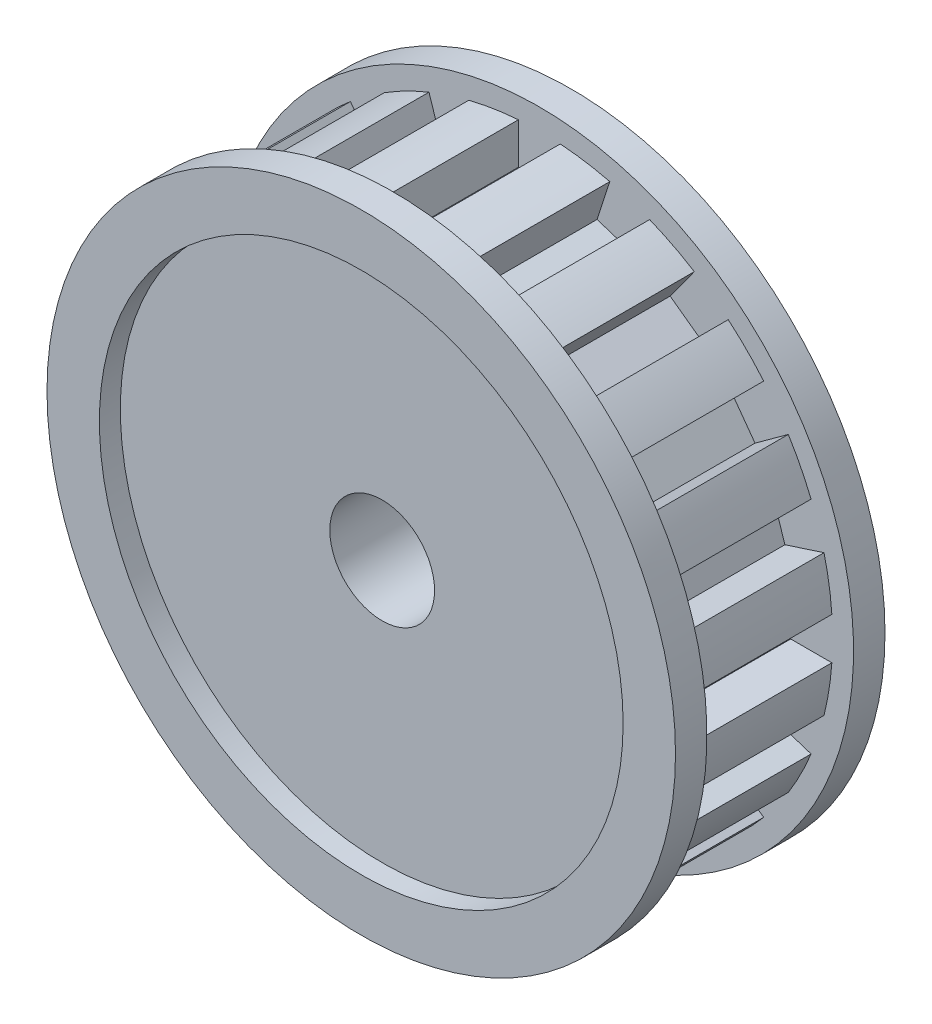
from build123d import *
from build123d.topology import SkipClean

# Parameters (mm, degrees)
SKETCH1_R           = 15
BOSS_EXTRUDE1_DEPTH = 10
CUT_EXTRUDE1_START  = -1.5
SKETCH2_W           = 2
SKETCH2_H           = 6
SKETCH2_W_2         = 6
SKETCH2_H_2         = 2
CUT_EXTRUDE1_DEPTH  = 7
CUT_EXTRUDE2_START  = -1
SKETCH3_R           = 12.5
CUT_EXTRUDE2_DEPTH  = 1
SKETCH4_R           = 12.5
CUT_EXTRUDE3_DEPTH  = 1
CUT_EXTRUDE4_START  = -7.5
SKETCH5_R           = 15
SKETCH5_R_2         = 14
CUT_EXTRUDE4_DEPTH  = 7
CUT_EXTRUDE5_START  = -10
SKETCH6_R           = 2.5
CUT_EXTRUDE5_DEPTH  = 10


with BuildPart() as part:
    # Sketch1 → Boss-Extrude1 (new body)
    with BuildSketch(Plane.XY):
        Circle(SKETCH1_R)
        with BuildLine():
            Line((-1.5, 2), (1.5, 2))
            ThreePointArc((1.5, 2), (0, -2.5), (-1.5, 2))
        make_face(mode=Mode.SUBTRACT)
    extrude(amount=BOSS_EXTRUDE1_DEPTH)

    # Sketch2 → Cut-Extrude1 (cut)
    with BuildSketch(Plane.XY.offset(10).offset(CUT_EXTRUDE1_START)):
        Polygon((2.757147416, 11.72169519), (4.659260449, 11.103661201), (6.513362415, 16.810000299), (4.611249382, 17.428034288), align=None)
        with Locations((0, 15)):
            Rectangle(SKETCH2_W, SKETCH2_H)
        Polygon((6.244406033, 10.295989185), (7.862440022, 9.12041868), (11.389151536, 13.974520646), (9.771117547, 15.150091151), align=None)
        Polygon((9.12041868, 7.862440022), (10.295989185, 6.244406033), (15.150091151, 9.771117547), (13.974520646, 11.389151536), align=None)
        Polygon((11.103661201, 4.659260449), (11.72169519, 2.757147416), (17.428034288, 4.611249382), (16.810000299, 6.513362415), align=None)
        with Locations((15, 0)):
            Rectangle(SKETCH2_W_2, SKETCH2_H_2)
        Polygon((11.72169519, -2.757147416), (11.103661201, -4.659260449), (16.810000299, -6.513362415), (17.428034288, -4.611249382), align=None)
        Polygon((10.295989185, -6.244406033), (9.12041868, -7.862440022), (13.974520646, -11.389151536), (15.150091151, -9.771117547), align=None)
        Polygon((7.862440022, -9.12041868), (6.244406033, -10.295989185), (9.771117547, -15.150091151), (11.389151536, -13.974520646), align=None)
        Polygon((4.659260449, -11.103661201), (2.757147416, -11.72169519), (4.611249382, -17.428034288), (6.513362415, -16.810000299), align=None)
        with Locations((0, -15)):
            Rectangle(SKETCH2_W, SKETCH2_H)
        Polygon((-2.757147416, -11.72169519), (-4.659260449, -11.103661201), (-6.513362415, -16.810000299), (-4.611249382, -17.428034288), align=None)
        Polygon((-6.244406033, -10.295989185), (-7.862440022, -9.12041868), (-11.389151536, -13.974520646), (-9.771117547, -15.150091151), align=None)
        Polygon((-9.12041868, -7.862440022), (-10.295989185, -6.244406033), (-15.150091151, -9.771117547), (-13.974520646, -11.389151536), align=None)
        Polygon((-11.103661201, -4.659260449), (-11.72169519, -2.757147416), (-17.428034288, -4.611249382), (-16.810000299, -6.513362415), align=None)
        with Locations((-15, 0)):
            Rectangle(SKETCH2_W_2, SKETCH2_H_2)
        Polygon((-11.72169519, 2.757147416), (-11.103661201, 4.659260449), (-16.810000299, 6.513362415), (-17.428034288, 4.611249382), align=None)
        Polygon((-10.295989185, 6.244406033), (-9.12041868, 7.862440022), (-13.974520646, 11.389151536), (-15.150091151, 9.771117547), align=None)
        Polygon((-7.862440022, 9.12041868), (-6.244406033, 10.295989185), (-9.771117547, 15.150091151), (-11.389151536, 13.974520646), align=None)
        Polygon((-4.659260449, 11.103661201), (-2.757147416, 11.72169519), (-4.611249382, 17.428034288), (-6.513362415, 16.810000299), align=None)
    extrude(amount=-CUT_EXTRUDE1_DEPTH, mode=Mode.SUBTRACT)

    # Sketch3 → Cut-Extrude2 (cut)
    with BuildSketch(Plane.XY.offset(10).offset(CUT_EXTRUDE2_START)):
        Circle(SKETCH3_R)
        with BuildLine():
            Line((1.5, 2), (-1.5, 2))
            ThreePointArc((-1.5, 2), (0, -2.5), (1.5, 2))
        make_face(mode=Mode.SUBTRACT)
    extrude(amount=CUT_EXTRUDE2_DEPTH, mode=Mode.SUBTRACT)

    # Sketch4 → Cut-Extrude3 (cut)
    with BuildSketch(Plane(origin=(0, 0, 0), x_dir=(-1, 0, 0), z_dir=(0, 0, -1))):
        with Locations(Location((0, 0, 0), (0, 0, 180))):
            Circle(SKETCH4_R)
        with BuildLine():
            Line((1.5, 2), (-1.5, 2))
            ThreePointArc((-1.5, 2), (0, -2.5), (1.5, 2))
        make_face(mode=Mode.SUBTRACT)
    extrude(amount=-CUT_EXTRUDE3_DEPTH, mode=Mode.SUBTRACT)

    # Sketch5 → Cut-Extrude4 (cut)
    with BuildSketch(Plane.XY.offset(9).offset(CUT_EXTRUDE4_START)):
        with Locations(Location((0, 0, 0), (0, 0, 180))):
            Circle(SKETCH5_R)
        Circle(SKETCH5_R_2, mode=Mode.SUBTRACT)
    extrude(amount=CUT_EXTRUDE4_DEPTH, mode=Mode.SUBTRACT)

    # Sketch6 → Cut-Extrude5 (cut)
    with SkipClean():  # the faces are left unmerged after this step: merging them gives an invalid solid
        with BuildSketch(Plane.XY.offset(9).offset(CUT_EXTRUDE5_START)):
            with Locations(Location((0, 0, 0), (0, 0, 180))):
                Circle(SKETCH6_R)
        extrude(amount=CUT_EXTRUDE5_DEPTH, mode=Mode.SUBTRACT)


solid = part.part
